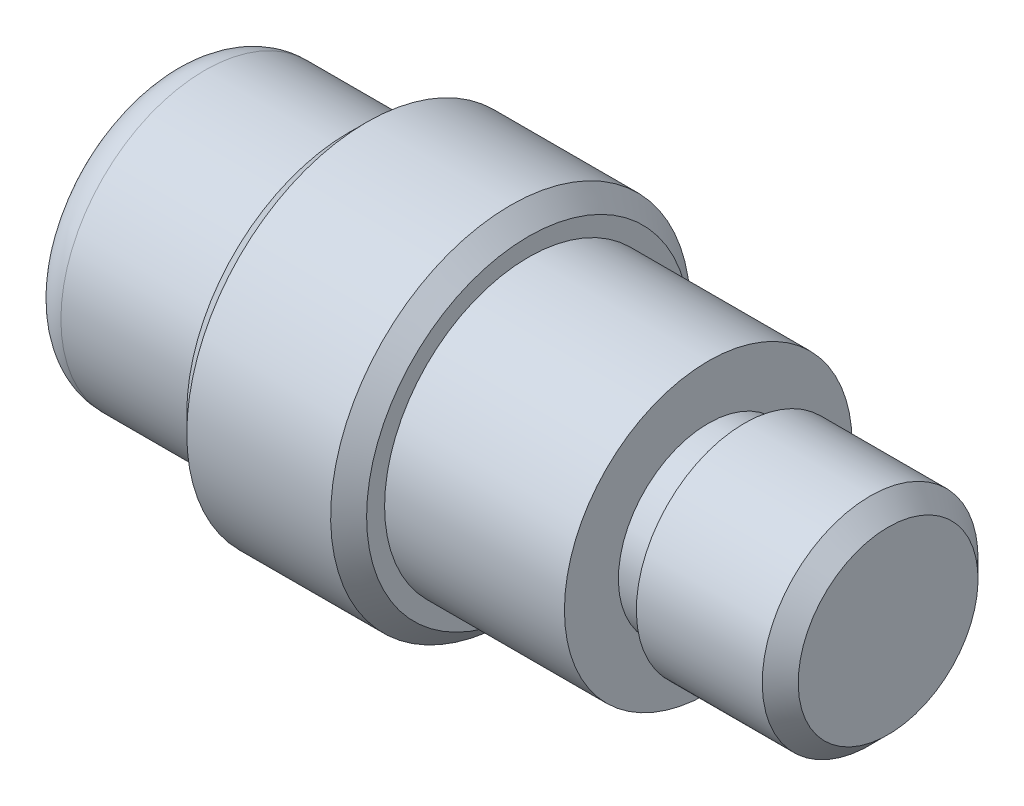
from build123d import *

# Parameters (mm, degrees)
CHAMFER_3_SIZE = 1
FILLET_2_R     = 2


with BuildPart() as part:
    # Sketch 1 → Revolve 2 (revolve)
    with BuildSketch(Plane.XY):
        Polygon((-30, 0), (-30, 8), (-20, 8), (-20, 10), (-10, 10), (-10, 8), (0, 8), (0, 5), (2, 5), (2, 6), (10, 6), (10, 0), align=None)
    revolve(axis=Axis((38.789808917, 0, 0), (-1, 0, 0)))

    # Chamfer 3
    chamfer_3_edges = [part.edges().sort_by_distance(p)[0] for p in [
        (-10, -10, 0),
        (-20, -10, 0),
        (10, -6, 0),
    ]]
    chamfer(chamfer_3_edges, length=CHAMFER_3_SIZE)

    # Fillet 2
    fillet_2_edges = [part.edges().sort_by_distance(p)[0] for p in [
        (-30, -8, 0),
    ]]
    fillet(fillet_2_edges, radius=FILLET_2_R)


solid = part.part
